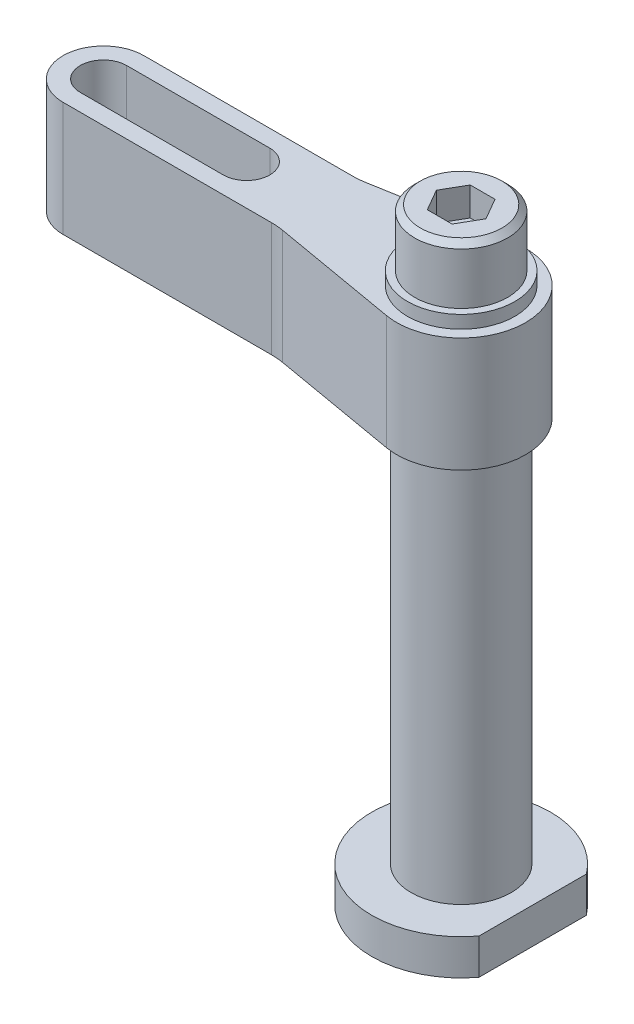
ISO-10303-21;
HEADER;
FILE_DESCRIPTION(('STEP AP214'),'2;1');
FILE_NAME('part.step','',(''),(''),'','','');
FILE_SCHEMA(('AUTOMOTIVE_DESIGN { 1 0 10303 214 1 1 1 1 }'));
ENDSEC;
DATA;
#1=APPLICATION_CONTEXT('core data for automotive mechanical design processes');
#2=APPLICATION_PROTOCOL_DEFINITION('international standard','automotive_design',2000,#1);
#3=PRODUCT_CONTEXT('',#1,'mechanical');
#4=PRODUCT('Part','Part','',(#3));
#5=PRODUCT_RELATED_PRODUCT_CATEGORY('part','',(#4));
#6=PRODUCT_DEFINITION_FORMATION('','',#4);
#7=PRODUCT_DEFINITION_CONTEXT('part definition',#1,'design');
#8=PRODUCT_DEFINITION('design','',#6,#7);
#9=PRODUCT_DEFINITION_SHAPE('','',#8);
#10=(LENGTH_UNIT() NAMED_UNIT(*) SI_UNIT(.MILLI.,.METRE.));
#11=(NAMED_UNIT(*) PLANE_ANGLE_UNIT() SI_UNIT($,.RADIAN.));
#12=(NAMED_UNIT(*) SI_UNIT($,.STERADIAN.) SOLID_ANGLE_UNIT());
#13=UNCERTAINTY_MEASURE_WITH_UNIT(LENGTH_MEASURE(1.E-05),#10,'distance_accuracy_value','');
#14=(GEOMETRIC_REPRESENTATION_CONTEXT(3) GLOBAL_UNCERTAINTY_ASSIGNED_CONTEXT((#13)) GLOBAL_UNIT_ASSIGNED_CONTEXT((#10,
#11,#12)) REPRESENTATION_CONTEXT('',''));
#15=CARTESIAN_POINT('',(0.,0.,0.));
#16=DIRECTION('',(0.,0.,1.));
#17=DIRECTION('',(1.,0.,0.));
#18=AXIS2_PLACEMENT_3D('',#15,#16,#17);
#19=CARTESIAN_POINT('',(0.,80.8,0.));
#20=DIRECTION('',(0.,1.,0.));
#21=DIRECTION('',(0.,0.,1.));
#22=AXIS2_PLACEMENT_3D('',#19,#20,#21);
#23=PLANE('',#22);
#24=DIRECTION('',(-0.5,0.,-0.866025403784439));
#25=VECTOR('',#24,1.);
#26=CARTESIAN_POINT('',(3.46410161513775,80.8,0.));
#27=LINE('',#26,#25);
#28=CARTESIAN_POINT('',(3.46410161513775,80.8,0.));
#29=VERTEX_POINT('',#28);
#30=CARTESIAN_POINT('',(1.73205080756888,80.8,-3.));
#31=VERTEX_POINT('',#30);
#32=EDGE_CURVE('E218',#29,#31,#27,.T.);
#33=ORIENTED_EDGE('',*,*,#32,.T.);
#34=DIRECTION('',(-1.,0.,0.));
#35=VECTOR('',#34,1.);
#36=CARTESIAN_POINT('',(1.73205080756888,80.8,-3.));
#37=LINE('',#36,#35);
#38=CARTESIAN_POINT('',(-1.73205080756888,80.8,-3.));
#39=VERTEX_POINT('',#38);
#40=EDGE_CURVE('E212',#31,#39,#37,.T.);
#41=ORIENTED_EDGE('',*,*,#40,.T.);
#42=DIRECTION('',(-0.5,0.,0.866025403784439));
#43=VECTOR('',#42,1.);
#44=CARTESIAN_POINT('',(-1.73205080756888,80.8,-3.));
#45=LINE('',#44,#43);
#46=CARTESIAN_POINT('',(-3.46410161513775,80.8,0.));
#47=VERTEX_POINT('',#46);
#48=EDGE_CURVE('E206',#39,#47,#45,.T.);
#49=ORIENTED_EDGE('',*,*,#48,.T.);
#50=DIRECTION('',(0.5,0.,0.866025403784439));
#51=VECTOR('',#50,1.);
#52=CARTESIAN_POINT('',(-3.46410161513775,80.8,0.));
#53=LINE('',#52,#51);
#54=CARTESIAN_POINT('',(-1.73205080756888,80.8,3.));
#55=VERTEX_POINT('',#54);
#56=EDGE_CURVE('E200',#47,#55,#53,.T.);
#57=ORIENTED_EDGE('',*,*,#56,.T.);
#58=DIRECTION('',(1.,0.,0.));
#59=VECTOR('',#58,1.);
#60=CARTESIAN_POINT('',(-1.73205080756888,80.8,3.));
#61=LINE('',#60,#59);
#62=CARTESIAN_POINT('',(1.73205080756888,80.8,3.));
#63=VERTEX_POINT('',#62);
#64=EDGE_CURVE('E230',#55,#63,#61,.T.);
#65=ORIENTED_EDGE('',*,*,#64,.T.);
#66=DIRECTION('',(0.5,0.,-0.866025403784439));
#67=VECTOR('',#66,1.);
#68=CARTESIAN_POINT('',(1.73205080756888,80.8,3.));
#69=LINE('',#68,#67);
#70=EDGE_CURVE('E224',#63,#29,#69,.T.);
#71=ORIENTED_EDGE('',*,*,#70,.T.);
#72=EDGE_LOOP('',(#33,#41,#49,#57,#65,#71));
#73=FACE_BOUND('',#72,.T.);
#74=ADVANCED_FACE('F16',(#73),#23,.T.);
#75=CARTESIAN_POINT('',(-1.73205080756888,80.8,3.));
#76=DIRECTION('',(0.,0.,1.));
#77=DIRECTION('',(1.,0.,0.));
#78=AXIS2_PLACEMENT_3D('',#75,#76,#77);
#79=PLANE('',#78);
#80=DIRECTION('',(0.,1.,0.));
#81=VECTOR('',#80,1.);
#82=CARTESIAN_POINT('',(1.73205080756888,80.8,3.));
#83=LINE('',#82,#81);
#84=CARTESIAN_POINT('',(1.73205080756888,84.8,3.));
#85=VERTEX_POINT('',#84);
#86=EDGE_CURVE('E227',#85,#63,#83,.F.);
#87=ORIENTED_EDGE('',*,*,#86,.T.);
#88=ORIENTED_EDGE('',*,*,#64,.F.);
#89=DIRECTION('',(0.,1.,0.));
#90=VECTOR('',#89,1.);
#91=CARTESIAN_POINT('',(-1.73205080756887,80.8,3.));
#92=LINE('',#91,#90);
#93=CARTESIAN_POINT('',(-1.73205080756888,84.8,3.));
#94=VERTEX_POINT('',#93);
#95=EDGE_CURVE('E197',#55,#94,#92,.T.);
#96=ORIENTED_EDGE('',*,*,#95,.T.);
#97=DIRECTION('',(1.,0.,0.));
#98=VECTOR('',#97,1.);
#99=CARTESIAN_POINT('',(0.,84.8,3.));
#100=LINE('',#99,#98);
#101=EDGE_CURVE('E194',#94,#85,#100,.T.);
#102=ORIENTED_EDGE('',*,*,#101,.T.);
#103=EDGE_LOOP('',(#87,#88,#96,#102));
#104=FACE_BOUND('',#103,.T.);
#105=ADVANCED_FACE('F643',(#104),#79,.F.);
#106=CARTESIAN_POINT('',(1.73205080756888,80.8,3.));
#107=DIRECTION('',(0.866025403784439,0.,0.5));
#108=DIRECTION('',(0.5,0.,-0.866025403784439));
#109=AXIS2_PLACEMENT_3D('',#106,#107,#108);
#110=PLANE('',#109);
#111=DIRECTION('',(0.,1.,0.));
#112=VECTOR('',#111,1.);
#113=CARTESIAN_POINT('',(3.46410161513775,80.8,0.));
#114=LINE('',#113,#112);
#115=CARTESIAN_POINT('',(3.46410161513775,84.8,0.));
#116=VERTEX_POINT('',#115);
#117=EDGE_CURVE('E221',#116,#29,#114,.F.);
#118=ORIENTED_EDGE('',*,*,#117,.T.);
#119=ORIENTED_EDGE('',*,*,#70,.F.);
#120=ORIENTED_EDGE('',*,*,#86,.F.);
#121=DIRECTION('',(0.499999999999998,0.,-0.866025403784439));
#122=VECTOR('',#121,1.);
#123=CARTESIAN_POINT('',(1.73205080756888,84.8,3.));
#124=LINE('',#123,#122);
#125=EDGE_CURVE('E191',#85,#116,#124,.T.);
#126=ORIENTED_EDGE('',*,*,#125,.T.);
#127=EDGE_LOOP('',(#118,#119,#120,#126));
#128=FACE_BOUND('',#127,.T.);
#129=ADVANCED_FACE('F634',(#128),#110,.F.);
#130=CARTESIAN_POINT('',(3.46410161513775,80.8,0.));
#131=DIRECTION('',(0.866025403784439,0.,-0.5));
#132=DIRECTION('',(-0.5,0.,-0.866025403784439));
#133=AXIS2_PLACEMENT_3D('',#130,#131,#132);
#134=PLANE('',#133);
#135=DIRECTION('',(0.,1.,0.));
#136=VECTOR('',#135,1.);
#137=CARTESIAN_POINT('',(1.73205080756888,80.8,-3.));
#138=LINE('',#137,#136);
#139=CARTESIAN_POINT('',(1.73205080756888,84.8,-3.));
#140=VERTEX_POINT('',#139);
#141=EDGE_CURVE('E215',#140,#31,#138,.F.);
#142=ORIENTED_EDGE('',*,*,#141,.T.);
#143=ORIENTED_EDGE('',*,*,#32,.F.);
#144=ORIENTED_EDGE('',*,*,#117,.F.);
#145=DIRECTION('',(-0.499999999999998,0.,-0.866025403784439));
#146=VECTOR('',#145,1.);
#147=CARTESIAN_POINT('',(3.46410161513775,84.8,0.));
#148=LINE('',#147,#146);
#149=EDGE_CURVE('E188',#116,#140,#148,.T.);
#150=ORIENTED_EDGE('',*,*,#149,.T.);
#151=EDGE_LOOP('',(#142,#143,#144,#150));
#152=FACE_BOUND('',#151,.T.);
#153=ADVANCED_FACE('F625',(#152),#134,.F.);
#154=CARTESIAN_POINT('',(1.73205080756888,80.8,-3.));
#155=DIRECTION('',(0.,0.,-1.));
#156=DIRECTION('',(-1.,0.,0.));
#157=AXIS2_PLACEMENT_3D('',#154,#155,#156);
#158=PLANE('',#157);
#159=DIRECTION('',(0.,1.,0.));
#160=VECTOR('',#159,1.);
#161=CARTESIAN_POINT('',(-1.73205080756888,80.8,-3.));
#162=LINE('',#161,#160);
#163=CARTESIAN_POINT('',(-1.73205080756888,84.8,-3.));
#164=VERTEX_POINT('',#163);
#165=EDGE_CURVE('E209',#164,#39,#162,.F.);
#166=ORIENTED_EDGE('',*,*,#165,.T.);
#167=ORIENTED_EDGE('',*,*,#40,.F.);
#168=ORIENTED_EDGE('',*,*,#141,.F.);
#169=DIRECTION('',(1.,0.,0.));
#170=VECTOR('',#169,1.);
#171=CARTESIAN_POINT('',(0.,84.8,-3.));
#172=LINE('',#171,#170);
#173=EDGE_CURVE('E185',#140,#164,#172,.F.);
#174=ORIENTED_EDGE('',*,*,#173,.T.);
#175=EDGE_LOOP('',(#166,#167,#168,#174));
#176=FACE_BOUND('',#175,.T.);
#177=ADVANCED_FACE('F616',(#176),#158,.F.);
#178=CARTESIAN_POINT('',(-1.73205080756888,80.8,-3.));
#179=DIRECTION('',(-0.866025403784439,0.,-0.5));
#180=DIRECTION('',(-0.5,0.,0.866025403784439));
#181=AXIS2_PLACEMENT_3D('',#178,#179,#180);
#182=PLANE('',#181);
#183=DIRECTION('',(0.,1.,0.));
#184=VECTOR('',#183,1.);
#185=CARTESIAN_POINT('',(-3.46410161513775,80.8,0.));
#186=LINE('',#185,#184);
#187=CARTESIAN_POINT('',(-3.46410161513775,84.8,0.));
#188=VERTEX_POINT('',#187);
#189=EDGE_CURVE('E203',#188,#47,#186,.F.);
#190=ORIENTED_EDGE('',*,*,#189,.T.);
#191=ORIENTED_EDGE('',*,*,#48,.F.);
#192=ORIENTED_EDGE('',*,*,#165,.F.);
#193=DIRECTION('',(-0.499999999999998,0.,0.866025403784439));
#194=VECTOR('',#193,1.);
#195=CARTESIAN_POINT('',(-1.73205080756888,84.8,-3.));
#196=LINE('',#195,#194);
#197=EDGE_CURVE('E182',#164,#188,#196,.T.);
#198=ORIENTED_EDGE('',*,*,#197,.T.);
#199=EDGE_LOOP('',(#190,#191,#192,#198));
#200=FACE_BOUND('',#199,.T.);
#201=ADVANCED_FACE('F300',(#200),#182,.F.);
#202=CARTESIAN_POINT('',(-3.46410161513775,80.8,0.));
#203=DIRECTION('',(-0.866025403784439,0.,0.5));
#204=DIRECTION('',(0.5,0.,0.866025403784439));
#205=AXIS2_PLACEMENT_3D('',#202,#203,#204);
#206=PLANE('',#205);
#207=ORIENTED_EDGE('',*,*,#95,.F.);
#208=ORIENTED_EDGE('',*,*,#56,.F.);
#209=ORIENTED_EDGE('',*,*,#189,.F.);
#210=DIRECTION('',(0.499999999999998,0.,0.866025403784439));
#211=VECTOR('',#210,1.);
#212=CARTESIAN_POINT('',(-3.46410161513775,84.8,0.));
#213=LINE('',#212,#211);
#214=EDGE_CURVE('E179',#188,#94,#213,.T.);
#215=ORIENTED_EDGE('',*,*,#214,.T.);
#216=EDGE_LOOP('',(#207,#208,#209,#215));
#217=FACE_BOUND('',#216,.T.);
#218=ADVANCED_FACE('F290',(#217),#206,.F.);
#219=CARTESIAN_POINT('',(0.,84.8,0.));
#220=DIRECTION('',(0.,-1.,0.));
#221=DIRECTION('',(0.,0.,-1.));
#222=AXIS2_PLACEMENT_3D('',#219,#220,#221);
#223=PLANE('',#222);
#224=ORIENTED_EDGE('',*,*,#197,.F.);
#225=ORIENTED_EDGE('',*,*,#173,.F.);
#226=ORIENTED_EDGE('',*,*,#149,.F.);
#227=ORIENTED_EDGE('',*,*,#125,.F.);
#228=ORIENTED_EDGE('',*,*,#101,.F.);
#229=ORIENTED_EDGE('',*,*,#214,.F.);
#230=EDGE_LOOP('',(#224,#225,#226,#227,#228,#229));
#231=FACE_BOUND('',#230,.T.);
#232=CARTESIAN_POINT('',(0.,84.7999999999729,0.));
#233=DIRECTION('',(0.,-1.,0.));
#234=DIRECTION('',(0.,0.,-1.));
#235=AXIS2_PLACEMENT_3D('',#232,#233,#234);
#236=CIRCLE('',#235,5.69999999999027);
#237=CARTESIAN_POINT('',(0.,84.7999999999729,-5.69999999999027));
#238=VERTEX_POINT('',#237);
#239=EDGE_CURVE('E176',#238,#238,#236,.T.);
#240=ORIENTED_EDGE('',*,*,#239,.F.);
#241=EDGE_LOOP('',(#240));
#242=FACE_BOUND('',#241,.T.);
#243=ADVANCED_FACE('F288',(#231,#242),#223,.F.);
#244=CARTESIAN_POINT('',(0.,84.0000000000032,0.));
#245=DIRECTION('',(0.,-1.,0.));
#246=DIRECTION('',(0.,0.,-1.));
#247=AXIS2_PLACEMENT_3D('',#244,#245,#246);
#248=CONICAL_SURFACE('',#247,6.49999999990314,0.785398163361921);
#249=ORIENTED_EDGE('',*,*,#239,.T.);
#250=EDGE_LOOP('',(#249));
#251=FACE_BOUND('',#250,.T.);
#252=CARTESIAN_POINT('',(0.,84.,0.));
#253=DIRECTION('',(0.,1.,0.));
#254=DIRECTION('',(0.,0.,1.));
#255=AXIS2_PLACEMENT_3D('',#252,#253,#254);
#256=CIRCLE('',#255,6.5);
#257=CARTESIAN_POINT('',(0.,84.,6.5));
#258=VERTEX_POINT('',#257);
#259=EDGE_CURVE('E172',#258,#258,#256,.F.);
#260=ORIENTED_EDGE('',*,*,#259,.F.);
#261=EDGE_LOOP('',(#260));
#262=FACE_BOUND('',#261,.T.);
#263=ADVANCED_FACE('F285',(#251,#262),#248,.T.);
#264=CARTESIAN_POINT('',(0.,0.,0.));
#265=DIRECTION('',(0.,1.,0.));
#266=DIRECTION('',(0.,0.,1.));
#267=AXIS2_PLACEMENT_3D('',#264,#265,#266);
#268=CYLINDRICAL_SURFACE('',#267,6.5);
#269=ORIENTED_EDGE('',*,*,#259,.T.);
#270=EDGE_LOOP('',(#269));
#271=FACE_BOUND('',#270,.T.);
#272=CARTESIAN_POINT('',(0.,76.8,0.));
#273=DIRECTION('',(0.,1.,0.));
#274=DIRECTION('',(0.,0.,1.));
#275=AXIS2_PLACEMENT_3D('',#272,#273,#274);
#276=CIRCLE('',#275,6.5);
#277=CARTESIAN_POINT('',(0.,76.8,6.5));
#278=VERTEX_POINT('',#277);
#279=EDGE_CURVE('E175',#278,#278,#276,.T.);
#280=ORIENTED_EDGE('',*,*,#279,.T.);
#281=EDGE_LOOP('',(#280));
#282=FACE_BOUND('',#281,.T.);
#283=ADVANCED_FACE('F298',(#271,#282),#268,.T.);
#284=CARTESIAN_POINT('',(6.5,76.8,0.));
#285=DIRECTION('',(0.,-1.,0.));
#286=DIRECTION('',(0.,0.,-1.));
#287=AXIS2_PLACEMENT_3D('',#284,#285,#286);
#288=PLANE('',#287);
#289=ORIENTED_EDGE('',*,*,#279,.F.);
#290=EDGE_LOOP('',(#289));
#291=FACE_BOUND('',#290,.T.);
#292=CARTESIAN_POINT('',(0.,76.8,0.));
#293=DIRECTION('',(0.,1.,0.));
#294=DIRECTION('',(0.,0.,1.));
#295=AXIS2_PLACEMENT_3D('',#292,#293,#294);
#296=CIRCLE('',#295,7.5);
#297=CARTESIAN_POINT('',(0.,76.8,7.5));
#298=VERTEX_POINT('',#297);
#299=EDGE_CURVE('E274',#298,#298,#296,.F.);
#300=ORIENTED_EDGE('',*,*,#299,.F.);
#301=EDGE_LOOP('',(#300));
#302=FACE_BOUND('',#301,.T.);
#303=ADVANCED_FACE('F378',(#291,#302),#288,.F.);
#304=CARTESIAN_POINT('',(0.,0.,0.));
#305=DIRECTION('',(0.,1.,0.));
#306=DIRECTION('',(0.,0.,1.));
#307=AXIS2_PLACEMENT_3D('',#304,#305,#306);
#308=CYLINDRICAL_SURFACE('',#307,7.5);
#309=ORIENTED_EDGE('',*,*,#299,.T.);
#310=EDGE_LOOP('',(#309));
#311=FACE_BOUND('',#310,.T.);
#312=CARTESIAN_POINT('',(0.,75.,0.));
#313=DIRECTION('',(0.,1.,0.));
#314=DIRECTION('',(0.,0.,1.));
#315=AXIS2_PLACEMENT_3D('',#312,#313,#314);
#316=CIRCLE('',#315,7.5);
#317=CARTESIAN_POINT('',(0.,75.,7.5));
#318=VERTEX_POINT('',#317);
#319=EDGE_CURVE('E142',#318,#318,#316,.F.);
#320=ORIENTED_EDGE('',*,*,#319,.F.);
#321=EDGE_LOOP('',(#320));
#322=FACE_BOUND('',#321,.T.);
#323=ADVANCED_FACE('F374',(#311,#322),#308,.T.);
#324=CARTESIAN_POINT('',(12.5,0.,0.));
#325=DIRECTION('',(0.,1.,0.));
#326=DIRECTION('',(0.,0.,1.));
#327=AXIS2_PLACEMENT_3D('',#324,#325,#326);
#328=PLANE('',#327);
#329=CARTESIAN_POINT('',(0.,0.,0.));
#330=DIRECTION('',(0.,1.,0.));
#331=DIRECTION('',(0.,0.,1.));
#332=AXIS2_PLACEMENT_3D('',#329,#330,#331);
#333=CIRCLE('',#332,12.5);
#334=CARTESIAN_POINT('',(10.,0.,-7.5));
#335=VERTEX_POINT('',#334);
#336=CARTESIAN_POINT('',(10.,0.,7.5));
#337=VERTEX_POINT('',#336);
#338=EDGE_CURVE('E264',#335,#337,#333,.T.);
#339=ORIENTED_EDGE('',*,*,#338,.F.);
#340=DIRECTION('',(0.,0.,-1.));
#341=VECTOR('',#340,1.);
#342=CARTESIAN_POINT('',(10.,0.,-10.));
#343=LINE('',#342,#341);
#344=EDGE_CURVE('E167',#337,#335,#343,.T.);
#345=ORIENTED_EDGE('',*,*,#344,.F.);
#346=EDGE_LOOP('',(#339,#345));
#347=FACE_BOUND('',#346,.T.);
#348=ADVANCED_FACE('F371',(#347),#328,.F.);
#349=CARTESIAN_POINT('',(-20.864897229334,75.,15.6500000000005));
#350=DIRECTION('',(0.,1.,0.));
#351=DIRECTION('',(0.,0.,1.));
#352=AXIS2_PLACEMENT_3D('',#349,#350,#351);
#353=CYLINDRICAL_SURFACE('',#352,10.);
#354=DIRECTION('',(0.,1.,0.));
#355=VECTOR('',#354,1.);
#356=CARTESIAN_POINT('',(-19.1479463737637,75.,5.79849860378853));
#357=LINE('',#356,#355);
#358=CARTESIAN_POINT('',(-19.1479463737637,59.,5.79849860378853));
#359=VERTEX_POINT('',#358);
#360=CARTESIAN_POINT('',(-19.1479463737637,75.,5.79849860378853));
#361=VERTEX_POINT('',#360);
#362=EDGE_CURVE('E126',#359,#361,#357,.T.);
#363=ORIENTED_EDGE('',*,*,#362,.T.);
#364=CARTESIAN_POINT('',(-20.864897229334,75.,15.6500000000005));
#365=DIRECTION('',(0.,1.,0.));
#366=DIRECTION('',(0.,0.,1.));
#367=AXIS2_PLACEMENT_3D('',#364,#365,#366);
#368=CIRCLE('',#367,10.);
#369=CARTESIAN_POINT('',(-20.864897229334,75.,5.65));
#370=VERTEX_POINT('',#369);
#371=EDGE_CURVE('E124',#370,#361,#368,.F.);
#372=ORIENTED_EDGE('',*,*,#371,.F.);
#373=DIRECTION('',(0.,1.,0.));
#374=VECTOR('',#373,1.);
#375=CARTESIAN_POINT('',(-20.864897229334,75.,5.65));
#376=LINE('',#375,#374);
#377=CARTESIAN_POINT('',(-20.864897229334,59.,5.65));
#378=VERTEX_POINT('',#377);
#379=EDGE_CURVE('E131',#370,#378,#376,.F.);
#380=ORIENTED_EDGE('',*,*,#379,.T.);
#381=CARTESIAN_POINT('',(-20.864897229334,59.,15.6500000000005));
#382=DIRECTION('',(0.,1.,0.));
#383=DIRECTION('',(0.,0.,1.));
#384=AXIS2_PLACEMENT_3D('',#381,#382,#383);
#385=CIRCLE('',#384,10.);
#386=EDGE_CURVE('E48',#359,#378,#385,.T.);
#387=ORIENTED_EDGE('',*,*,#386,.F.);
#388=EDGE_LOOP('',(#363,#372,#380,#387));
#389=FACE_BOUND('',#388,.T.);
#390=ADVANCED_FACE('F127',(#389),#353,.F.);
#391=CARTESIAN_POINT('',(-20.864897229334,75.,-15.6500000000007));
#392=DIRECTION('',(0.,1.,0.));
#393=DIRECTION('',(0.,0.,1.));
#394=AXIS2_PLACEMENT_3D('',#391,#392,#393);
#395=CYLINDRICAL_SURFACE('',#394,10.);
#396=DIRECTION('',(0.,1.,0.));
#397=VECTOR('',#396,1.);
#398=CARTESIAN_POINT('',(-20.864897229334,75.,-5.65));
#399=LINE('',#398,#397);
#400=CARTESIAN_POINT('',(-20.864897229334,59.,-5.65));
#401=VERTEX_POINT('',#400);
#402=CARTESIAN_POINT('',(-20.864897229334,75.,-5.65));
#403=VERTEX_POINT('',#402);
#404=EDGE_CURVE('E718',#401,#403,#399,.T.);
#405=ORIENTED_EDGE('',*,*,#404,.T.);
#406=CARTESIAN_POINT('',(-20.864897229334,75.,-15.6500000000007));
#407=DIRECTION('',(0.,1.,0.));
#408=DIRECTION('',(0.,0.,1.));
#409=AXIS2_PLACEMENT_3D('',#406,#407,#408);
#410=CIRCLE('',#409,10.);
#411=CARTESIAN_POINT('',(-19.1479463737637,75.,-5.79849860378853));
#412=VERTEX_POINT('',#411);
#413=EDGE_CURVE('E141',#412,#403,#410,.F.);
#414=ORIENTED_EDGE('',*,*,#413,.F.);
#415=DIRECTION('',(0.,1.,0.));
#416=VECTOR('',#415,1.);
#417=CARTESIAN_POINT('',(-19.1479463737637,75.,-5.79849860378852));
#418=LINE('',#417,#416);
#419=CARTESIAN_POINT('',(-19.1479463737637,59.,-5.79849860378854));
#420=VERTEX_POINT('',#419);
#421=EDGE_CURVE('E721',#412,#420,#418,.F.);
#422=ORIENTED_EDGE('',*,*,#421,.T.);
#423=CARTESIAN_POINT('',(-20.864897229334,59.,-15.6500000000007));
#424=DIRECTION('',(0.,1.,0.));
#425=DIRECTION('',(0.,0.,1.));
#426=AXIS2_PLACEMENT_3D('',#423,#424,#425);
#427=CIRCLE('',#426,10.);
#428=EDGE_CURVE('E34',#401,#420,#427,.T.);
#429=ORIENTED_EDGE('',*,*,#428,.F.);
#430=EDGE_LOOP('',(#405,#414,#422,#429));
#431=FACE_BOUND('',#430,.T.);
#432=ADVANCED_FACE('F366',(#431),#395,.F.);
#433=CARTESIAN_POINT('',(-50.,75.,0.));
#434=DIRECTION('',(0.,1.,0.));
#435=DIRECTION('',(0.,0.,1.));
#436=AXIS2_PLACEMENT_3D('',#433,#434,#435);
#437=PLANE('',#436);
#438=DIRECTION('',(0.985150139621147,0.,-0.171695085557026));
#439=VECTOR('',#438,1.);
#440=CARTESIAN_POINT('',(-1.54525577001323,75.,-8.86635125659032));
#441=LINE('',#440,#439);
#442=CARTESIAN_POINT('',(-1.54525577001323,75.,-8.86635125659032));
#443=VERTEX_POINT('',#442);
#444=EDGE_CURVE('E153',#443,#412,#441,.F.);
#445=ORIENTED_EDGE('',*,*,#444,.T.);
#446=ORIENTED_EDGE('',*,*,#413,.T.);
#447=DIRECTION('',(1.,0.,0.));
#448=VECTOR('',#447,1.);
#449=CARTESIAN_POINT('',(-20.864897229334,75.,-5.65));
#450=LINE('',#449,#448);
#451=CARTESIAN_POINT('',(-50.,75.,-5.65));
#452=VERTEX_POINT('',#451);
#453=EDGE_CURVE('E720',#403,#452,#450,.F.);
#454=ORIENTED_EDGE('',*,*,#453,.T.);
#455=CARTESIAN_POINT('',(-50.,75.,0.));
#456=DIRECTION('',(0.,1.,0.));
#457=DIRECTION('',(0.,0.,1.));
#458=AXIS2_PLACEMENT_3D('',#455,#456,#457);
#459=CIRCLE('',#458,5.65);
#460=CARTESIAN_POINT('',(-50.,75.,5.65));
#461=VERTEX_POINT('',#460);
#462=EDGE_CURVE('E257',#461,#452,#459,.F.);
#463=ORIENTED_EDGE('',*,*,#462,.F.);
#464=DIRECTION('',(-1.,0.,0.));
#465=VECTOR('',#464,1.);
#466=CARTESIAN_POINT('',(-50.,75.,5.65));
#467=LINE('',#466,#465);
#468=EDGE_CURVE('E139',#461,#370,#467,.F.);
#469=ORIENTED_EDGE('',*,*,#468,.T.);
#470=ORIENTED_EDGE('',*,*,#371,.T.);
#471=DIRECTION('',(-0.985150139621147,0.,-0.171695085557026));
#472=VECTOR('',#471,1.);
#473=CARTESIAN_POINT('',(-19.1479463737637,75.,5.79849860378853));
#474=LINE('',#473,#472);
#475=CARTESIAN_POINT('',(-1.54525577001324,75.,8.86635125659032));
#476=VERTEX_POINT('',#475);
#477=EDGE_CURVE('E130',#361,#476,#474,.F.);
#478=ORIENTED_EDGE('',*,*,#477,.T.);
#479=CARTESIAN_POINT('',(0.,75.,0.));
#480=DIRECTION('',(0.,1.,0.));
#481=DIRECTION('',(0.,0.,1.));
#482=AXIS2_PLACEMENT_3D('',#479,#480,#481);
#483=CIRCLE('',#482,9.);
#484=EDGE_CURVE('E148',#443,#476,#483,.F.);
#485=ORIENTED_EDGE('',*,*,#484,.F.);
#486=EDGE_LOOP('',(#445,#446,#454,#463,#469,#470,#478,#485));
#487=FACE_BOUND('',#486,.T.);
#488=DIRECTION('',(-1.,0.,0.));
#489=VECTOR('',#488,1.);
#490=CARTESIAN_POINT('',(-50.,75.,3.25));
#491=LINE('',#490,#489);
#492=CARTESIAN_POINT('',(-50.,75.,3.25));
#493=VERTEX_POINT('',#492);
#494=CARTESIAN_POINT('',(-30.,75.,3.25));
#495=VERTEX_POINT('',#494);
#496=EDGE_CURVE('E162',#493,#495,#491,.F.);
#497=ORIENTED_EDGE('',*,*,#496,.F.);
#498=CARTESIAN_POINT('',(-50.,75.,0.));
#499=DIRECTION('',(0.,1.,0.));
#500=DIRECTION('',(0.,0.,1.));
#501=AXIS2_PLACEMENT_3D('',#498,#499,#500);
#502=CIRCLE('',#501,3.25);
#503=CARTESIAN_POINT('',(-50.,75.,-3.25));
#504=VERTEX_POINT('',#503);
#505=EDGE_CURVE('E260',#493,#504,#502,.F.);
#506=ORIENTED_EDGE('',*,*,#505,.T.);
#507=DIRECTION('',(1.,0.,0.));
#508=VECTOR('',#507,1.);
#509=CARTESIAN_POINT('',(-30.,75.,-3.25));
#510=LINE('',#509,#508);
#511=CARTESIAN_POINT('',(-30.,75.,-3.25));
#512=VERTEX_POINT('',#511);
#513=EDGE_CURVE('E157',#512,#504,#510,.F.);
#514=ORIENTED_EDGE('',*,*,#513,.F.);
#515=CARTESIAN_POINT('',(-30.,75.,0.));
#516=DIRECTION('',(0.,1.,0.));
#517=DIRECTION('',(0.,0.,1.));
#518=AXIS2_PLACEMENT_3D('',#515,#516,#517);
#519=CIRCLE('',#518,3.25);
#520=EDGE_CURVE('E166',#512,#495,#519,.F.);
#521=ORIENTED_EDGE('',*,*,#520,.T.);
#522=EDGE_LOOP('',(#497,#506,#514,#521));
#523=FACE_BOUND('',#522,.T.);
#524=ORIENTED_EDGE('',*,*,#319,.T.);
#525=EDGE_LOOP('',(#524));
#526=FACE_BOUND('',#525,.T.);
#527=ADVANCED_FACE('F135',(#487,#523,#526),#437,.T.);
#528=CARTESIAN_POINT('',(0.,0.,0.));
#529=DIRECTION('',(0.,1.,0.));
#530=DIRECTION('',(0.,0.,1.));
#531=AXIS2_PLACEMENT_3D('',#528,#529,#530);
#532=CYLINDRICAL_SURFACE('',#531,12.5);
#533=DIRECTION('',(0.,1.,0.));
#534=VECTOR('',#533,1.);
#535=CARTESIAN_POINT('',(10.,5.,-7.5));
#536=LINE('',#535,#534);
#537=CARTESIAN_POINT('',(10.,5.,-7.5));
#538=VERTEX_POINT('',#537);
#539=EDGE_CURVE('E170',#335,#538,#536,.T.);
#540=ORIENTED_EDGE('',*,*,#539,.F.);
#541=ORIENTED_EDGE('',*,*,#338,.T.);
#542=DIRECTION('',(0.,1.,0.));
#543=VECTOR('',#542,1.);
#544=CARTESIAN_POINT('',(10.,5.,7.5));
#545=LINE('',#544,#543);
#546=CARTESIAN_POINT('',(10.,5.,7.5));
#547=VERTEX_POINT('',#546);
#548=EDGE_CURVE('E171',#547,#337,#545,.F.);
#549=ORIENTED_EDGE('',*,*,#548,.F.);
#550=CARTESIAN_POINT('',(0.,5.,0.));
#551=DIRECTION('',(0.,1.,0.));
#552=DIRECTION('',(0.,0.,1.));
#553=AXIS2_PLACEMENT_3D('',#550,#551,#552);
#554=CIRCLE('',#553,12.5);
#555=EDGE_CURVE('E254',#547,#538,#554,.F.);
#556=ORIENTED_EDGE('',*,*,#555,.T.);
#557=EDGE_LOOP('',(#540,#541,#549,#556));
#558=FACE_BOUND('',#557,.T.);
#559=ADVANCED_FACE('F359',(#558),#532,.T.);
#560=CARTESIAN_POINT('',(10.,5.,-10.));
#561=DIRECTION('',(1.,0.,0.));
#562=DIRECTION('',(0.,0.,-1.));
#563=AXIS2_PLACEMENT_3D('',#560,#561,#562);
#564=PLANE('',#563);
#565=ORIENTED_EDGE('',*,*,#539,.T.);
#566=DIRECTION('',(0.,0.,-1.));
#567=VECTOR('',#566,1.);
#568=CARTESIAN_POINT('',(10.,5.,0.));
#569=LINE('',#568,#567);
#570=EDGE_CURVE('E253',#538,#547,#569,.F.);
#571=ORIENTED_EDGE('',*,*,#570,.T.);
#572=ORIENTED_EDGE('',*,*,#548,.T.);
#573=ORIENTED_EDGE('',*,*,#344,.T.);
#574=EDGE_LOOP('',(#565,#571,#572,#573));
#575=FACE_BOUND('',#574,.T.);
#576=ADVANCED_FACE('F355',(#575),#564,.T.);
#577=CARTESIAN_POINT('',(-30.,75.,0.));
#578=DIRECTION('',(0.,1.,0.));
#579=DIRECTION('',(0.,0.,1.));
#580=AXIS2_PLACEMENT_3D('',#577,#578,#579);
#581=CYLINDRICAL_SURFACE('',#580,3.25);
#582=DIRECTION('',(0.,1.,0.));
#583=VECTOR('',#582,1.);
#584=CARTESIAN_POINT('',(-30.,75.,3.25));
#585=LINE('',#584,#583);
#586=CARTESIAN_POINT('',(-30.,59.,3.25));
#587=VERTEX_POINT('',#586);
#588=EDGE_CURVE('E165',#495,#587,#585,.F.);
#589=ORIENTED_EDGE('',*,*,#588,.F.);
#590=ORIENTED_EDGE('',*,*,#520,.F.);
#591=DIRECTION('',(0.,1.,0.));
#592=VECTOR('',#591,1.);
#593=CARTESIAN_POINT('',(-30.,75.,-3.25));
#594=LINE('',#593,#592);
#595=CARTESIAN_POINT('',(-30.,59.,-3.25));
#596=VERTEX_POINT('',#595);
#597=EDGE_CURVE('E161',#596,#512,#594,.T.);
#598=ORIENTED_EDGE('',*,*,#597,.F.);
#599=CARTESIAN_POINT('',(-30.,59.,0.));
#600=DIRECTION('',(0.,1.,0.));
#601=DIRECTION('',(0.,0.,1.));
#602=AXIS2_PLACEMENT_3D('',#599,#600,#601);
#603=CIRCLE('',#602,3.25);
#604=EDGE_CURVE('E251',#596,#587,#603,.F.);
#605=ORIENTED_EDGE('',*,*,#604,.T.);
#606=EDGE_LOOP('',(#589,#590,#598,#605));
#607=FACE_BOUND('',#606,.T.);
#608=ADVANCED_FACE('F351',(#607),#581,.F.);
#609=CARTESIAN_POINT('',(-50.,75.,3.25));
#610=DIRECTION('',(0.,0.,-1.));
#611=DIRECTION('',(-1.,0.,0.));
#612=AXIS2_PLACEMENT_3D('',#609,#610,#611);
#613=PLANE('',#612);
#614=ORIENTED_EDGE('',*,*,#496,.T.);
#615=ORIENTED_EDGE('',*,*,#588,.T.);
#616=DIRECTION('',(1.,0.,0.));
#617=VECTOR('',#616,1.);
#618=CARTESIAN_POINT('',(-50.,59.,3.25));
#619=LINE('',#618,#617);
#620=CARTESIAN_POINT('',(-50.,59.,3.25));
#621=VERTEX_POINT('',#620);
#622=EDGE_CURVE('E250',#587,#621,#619,.F.);
#623=ORIENTED_EDGE('',*,*,#622,.T.);
#624=DIRECTION('',(0.,1.,0.));
#625=VECTOR('',#624,1.);
#626=CARTESIAN_POINT('',(-50.,75.,3.25));
#627=LINE('',#626,#625);
#628=EDGE_CURVE('E262',#621,#493,#627,.T.);
#629=ORIENTED_EDGE('',*,*,#628,.T.);
#630=EDGE_LOOP('',(#614,#615,#623,#629));
#631=FACE_BOUND('',#630,.T.);
#632=ADVANCED_FACE('F347',(#631),#613,.T.);
#633=CARTESIAN_POINT('',(-50.,75.,0.));
#634=DIRECTION('',(0.,1.,0.));
#635=DIRECTION('',(0.,0.,1.));
#636=AXIS2_PLACEMENT_3D('',#633,#634,#635);
#637=CYLINDRICAL_SURFACE('',#636,3.25);
#638=DIRECTION('',(0.,1.,0.));
#639=VECTOR('',#638,1.);
#640=CARTESIAN_POINT('',(-50.,75.,-3.25));
#641=LINE('',#640,#639);
#642=CARTESIAN_POINT('',(-50.,59.,-3.25));
#643=VERTEX_POINT('',#642);
#644=EDGE_CURVE('E160',#504,#643,#641,.F.);
#645=ORIENTED_EDGE('',*,*,#644,.F.);
#646=ORIENTED_EDGE('',*,*,#505,.F.);
#647=ORIENTED_EDGE('',*,*,#628,.F.);
#648=CARTESIAN_POINT('',(-50.,59.,0.));
#649=DIRECTION('',(0.,1.,0.));
#650=DIRECTION('',(0.,0.,1.));
#651=AXIS2_PLACEMENT_3D('',#648,#649,#650);
#652=CIRCLE('',#651,3.25);
#653=EDGE_CURVE('E248',#621,#643,#652,.F.);
#654=ORIENTED_EDGE('',*,*,#653,.T.);
#655=EDGE_LOOP('',(#645,#646,#647,#654));
#656=FACE_BOUND('',#655,.T.);
#657=ADVANCED_FACE('F343',(#656),#637,.F.);
#658=CARTESIAN_POINT('',(-30.,75.,-3.25));
#659=DIRECTION('',(0.,0.,1.));
#660=DIRECTION('',(1.,0.,0.));
#661=AXIS2_PLACEMENT_3D('',#658,#659,#660);
#662=PLANE('',#661);
#663=ORIENTED_EDGE('',*,*,#513,.T.);
#664=ORIENTED_EDGE('',*,*,#644,.T.);
#665=DIRECTION('',(1.,0.,0.));
#666=VECTOR('',#665,1.);
#667=CARTESIAN_POINT('',(-50.,59.,-3.25));
#668=LINE('',#667,#666);
#669=EDGE_CURVE('E247',#643,#596,#668,.T.);
#670=ORIENTED_EDGE('',*,*,#669,.T.);
#671=ORIENTED_EDGE('',*,*,#597,.T.);
#672=EDGE_LOOP('',(#663,#664,#670,#671));
#673=FACE_BOUND('',#672,.T.);
#674=ADVANCED_FACE('F340',(#673),#662,.T.);
#675=CARTESIAN_POINT('',(-50.,75.,0.));
#676=DIRECTION('',(0.,1.,0.));
#677=DIRECTION('',(0.,0.,1.));
#678=AXIS2_PLACEMENT_3D('',#675,#676,#677);
#679=CYLINDRICAL_SURFACE('',#678,5.65);
#680=ORIENTED_EDGE('',*,*,#462,.T.);
#681=DIRECTION('',(0.,1.,0.));
#682=VECTOR('',#681,1.);
#683=CARTESIAN_POINT('',(-50.,75.,-5.65));
#684=LINE('',#683,#682);
#685=CARTESIAN_POINT('',(-50.,59.,-5.65));
#686=VERTEX_POINT('',#685);
#687=EDGE_CURVE('E255',#452,#686,#684,.F.);
#688=ORIENTED_EDGE('',*,*,#687,.T.);
#689=CARTESIAN_POINT('',(-50.,59.,0.));
#690=DIRECTION('',(0.,1.,0.));
#691=DIRECTION('',(0.,0.,1.));
#692=AXIS2_PLACEMENT_3D('',#689,#690,#691);
#693=CIRCLE('',#692,5.65);
#694=CARTESIAN_POINT('',(-50.,59.,5.65));
#695=VERTEX_POINT('',#694);
#696=EDGE_CURVE('E63',#686,#695,#693,.T.);
#697=ORIENTED_EDGE('',*,*,#696,.T.);
#698=DIRECTION('',(0.,1.,0.));
#699=VECTOR('',#698,1.);
#700=CARTESIAN_POINT('',(-50.,75.,5.65));
#701=LINE('',#700,#699);
#702=EDGE_CURVE('E156',#695,#461,#701,.T.);
#703=ORIENTED_EDGE('',*,*,#702,.T.);
#704=EDGE_LOOP('',(#680,#688,#697,#703));
#705=FACE_BOUND('',#704,.T.);
#706=ADVANCED_FACE('F336',(#705),#679,.T.);
#707=CARTESIAN_POINT('',(-50.,75.,5.65));
#708=DIRECTION('',(0.,0.,-1.));
#709=DIRECTION('',(-1.,0.,0.));
#710=AXIS2_PLACEMENT_3D('',#707,#708,#709);
#711=PLANE('',#710);
#712=ORIENTED_EDGE('',*,*,#379,.F.);
#713=ORIENTED_EDGE('',*,*,#468,.F.);
#714=ORIENTED_EDGE('',*,*,#702,.F.);
#715=DIRECTION('',(1.,0.,0.));
#716=VECTOR('',#715,1.);
#717=CARTESIAN_POINT('',(-50.,59.,5.65));
#718=LINE('',#717,#716);
#719=EDGE_CURVE('E246',#695,#378,#718,.T.);
#720=ORIENTED_EDGE('',*,*,#719,.T.);
#721=EDGE_LOOP('',(#712,#713,#714,#720));
#722=FACE_BOUND('',#721,.T.);
#723=ADVANCED_FACE('F333',(#722),#711,.F.);
#724=CARTESIAN_POINT('',(-19.1479463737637,75.,5.79849860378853));
#725=DIRECTION('',(0.171695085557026,0.,-0.985150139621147));
#726=DIRECTION('',(-0.985150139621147,0.,-0.171695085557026));
#727=AXIS2_PLACEMENT_3D('',#724,#725,#726);
#728=PLANE('',#727);
#729=DIRECTION('',(0.,1.,0.));
#730=VECTOR('',#729,1.);
#731=CARTESIAN_POINT('',(-1.54525577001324,75.,8.86635125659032));
#732=LINE('',#731,#730);
#733=CARTESIAN_POINT('',(-1.54525577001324,59.,8.86635125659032));
#734=VERTEX_POINT('',#733);
#735=EDGE_CURVE('E146',#476,#734,#732,.F.);
#736=ORIENTED_EDGE('',*,*,#735,.F.);
#737=ORIENTED_EDGE('',*,*,#477,.F.);
#738=ORIENTED_EDGE('',*,*,#362,.F.);
#739=DIRECTION('',(0.985150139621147,0.,0.171695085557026));
#740=VECTOR('',#739,1.);
#741=CARTESIAN_POINT('',(-19.1479463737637,59.,5.79849860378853));
#742=LINE('',#741,#740);
#743=EDGE_CURVE('E244',#359,#734,#742,.T.);
#744=ORIENTED_EDGE('',*,*,#743,.T.);
#745=EDGE_LOOP('',(#736,#737,#738,#744));
#746=FACE_BOUND('',#745,.T.);
#747=ADVANCED_FACE('F144',(#746),#728,.F.);
#748=CARTESIAN_POINT('',(0.,75.,0.));
#749=DIRECTION('',(0.,1.,0.));
#750=DIRECTION('',(0.,0.,1.));
#751=AXIS2_PLACEMENT_3D('',#748,#749,#750);
#752=CYLINDRICAL_SURFACE('',#751,9.);
#753=ORIENTED_EDGE('',*,*,#484,.T.);
#754=ORIENTED_EDGE('',*,*,#735,.T.);
#755=CARTESIAN_POINT('',(0.,59.,0.));
#756=DIRECTION('',(0.,1.,0.));
#757=DIRECTION('',(0.,0.,1.));
#758=AXIS2_PLACEMENT_3D('',#755,#756,#757);
#759=CIRCLE('',#758,9.);
#760=CARTESIAN_POINT('',(-1.54525577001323,59.,-8.86635125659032));
#761=VERTEX_POINT('',#760);
#762=EDGE_CURVE('E240',#734,#761,#759,.T.);
#763=ORIENTED_EDGE('',*,*,#762,.T.);
#764=DIRECTION('',(0.,1.,0.));
#765=VECTOR('',#764,1.);
#766=CARTESIAN_POINT('',(-1.54525577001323,75.,-8.86635125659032));
#767=LINE('',#766,#765);
#768=EDGE_CURVE('E698',#761,#443,#767,.T.);
#769=ORIENTED_EDGE('',*,*,#768,.T.);
#770=EDGE_LOOP('',(#753,#754,#763,#769));
#771=FACE_BOUND('',#770,.T.);
#772=ADVANCED_FACE('F326',(#771),#752,.T.);
#773=CARTESIAN_POINT('',(-1.54525577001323,75.,-8.86635125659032));
#774=DIRECTION('',(0.171695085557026,0.,0.985150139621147));
#775=DIRECTION('',(0.985150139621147,0.,-0.171695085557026));
#776=AXIS2_PLACEMENT_3D('',#773,#774,#775);
#777=PLANE('',#776);
#778=ORIENTED_EDGE('',*,*,#421,.F.);
#779=ORIENTED_EDGE('',*,*,#444,.F.);
#780=ORIENTED_EDGE('',*,*,#768,.F.);
#781=DIRECTION('',(-0.985150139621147,0.,0.171695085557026));
#782=VECTOR('',#781,1.);
#783=CARTESIAN_POINT('',(-1.54525577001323,59.,-8.86635125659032));
#784=LINE('',#783,#782);
#785=EDGE_CURVE('E243',#761,#420,#784,.T.);
#786=ORIENTED_EDGE('',*,*,#785,.T.);
#787=EDGE_LOOP('',(#778,#779,#780,#786));
#788=FACE_BOUND('',#787,.T.);
#789=ADVANCED_FACE('F322',(#788),#777,.F.);
#790=CARTESIAN_POINT('',(-20.864897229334,75.,-5.65));
#791=DIRECTION('',(0.,0.,1.));
#792=DIRECTION('',(1.,0.,0.));
#793=AXIS2_PLACEMENT_3D('',#790,#791,#792);
#794=PLANE('',#793);
#795=ORIENTED_EDGE('',*,*,#687,.F.);
#796=ORIENTED_EDGE('',*,*,#453,.F.);
#797=ORIENTED_EDGE('',*,*,#404,.F.);
#798=DIRECTION('',(1.,0.,0.));
#799=VECTOR('',#798,1.);
#800=CARTESIAN_POINT('',(-50.,59.,-5.65));
#801=LINE('',#800,#799);
#802=EDGE_CURVE('E237',#401,#686,#801,.F.);
#803=ORIENTED_EDGE('',*,*,#802,.T.);
#804=EDGE_LOOP('',(#795,#796,#797,#803));
#805=FACE_BOUND('',#804,.T.);
#806=ADVANCED_FACE('F318',(#805),#794,.F.);
#807=CARTESIAN_POINT('',(7.,5.,0.));
#808=DIRECTION('',(0.,-1.,0.));
#809=DIRECTION('',(0.,0.,-1.));
#810=AXIS2_PLACEMENT_3D('',#807,#808,#809);
#811=PLANE('',#810);
#812=CARTESIAN_POINT('',(0.,5.,0.));
#813=DIRECTION('',(0.,1.,0.));
#814=DIRECTION('',(0.,0.,1.));
#815=AXIS2_PLACEMENT_3D('',#812,#813,#814);
#816=CIRCLE('',#815,7.);
#817=CARTESIAN_POINT('',(0.,5.,7.));
#818=VERTEX_POINT('',#817);
#819=EDGE_CURVE('E25',#818,#818,#816,.T.);
#820=ORIENTED_EDGE('',*,*,#819,.F.);
#821=EDGE_LOOP('',(#820));
#822=FACE_BOUND('',#821,.T.);
#823=ORIENTED_EDGE('',*,*,#555,.F.);
#824=ORIENTED_EDGE('',*,*,#570,.F.);
#825=EDGE_LOOP('',(#823,#824));
#826=FACE_BOUND('',#825,.T.);
#827=ADVANCED_FACE('F312',(#822,#826),#811,.F.);
#828=CARTESIAN_POINT('',(-50.,59.,0.));
#829=DIRECTION('',(0.,1.,0.));
#830=DIRECTION('',(0.,0.,1.));
#831=AXIS2_PLACEMENT_3D('',#828,#829,#830);
#832=PLANE('',#831);
#833=ORIENTED_EDGE('',*,*,#428,.T.);
#834=ORIENTED_EDGE('',*,*,#785,.F.);
#835=ORIENTED_EDGE('',*,*,#762,.F.);
#836=ORIENTED_EDGE('',*,*,#743,.F.);
#837=ORIENTED_EDGE('',*,*,#386,.T.);
#838=ORIENTED_EDGE('',*,*,#719,.F.);
#839=ORIENTED_EDGE('',*,*,#696,.F.);
#840=ORIENTED_EDGE('',*,*,#802,.F.);
#841=EDGE_LOOP('',(#833,#834,#835,#836,#837,#838,#839,#840));
#842=FACE_BOUND('',#841,.T.);
#843=ORIENTED_EDGE('',*,*,#653,.F.);
#844=ORIENTED_EDGE('',*,*,#622,.F.);
#845=ORIENTED_EDGE('',*,*,#604,.F.);
#846=ORIENTED_EDGE('',*,*,#669,.F.);
#847=EDGE_LOOP('',(#843,#844,#845,#846));
#848=FACE_BOUND('',#847,.T.);
#849=CARTESIAN_POINT('',(0.,59.,0.));
#850=DIRECTION('',(0.,1.,0.));
#851=DIRECTION('',(0.,0.,1.));
#852=AXIS2_PLACEMENT_3D('',#849,#850,#851);
#853=CIRCLE('',#852,7.);
#854=CARTESIAN_POINT('',(0.,59.,7.));
#855=VERTEX_POINT('',#854);
#856=EDGE_CURVE('E11',#855,#855,#853,.F.);
#857=ORIENTED_EDGE('',*,*,#856,.F.);
#858=EDGE_LOOP('',(#857));
#859=FACE_BOUND('',#858,.T.);
#860=ADVANCED_FACE('F306',(#842,#848,#859),#832,.F.);
#861=CARTESIAN_POINT('',(0.,0.,0.));
#862=DIRECTION('',(0.,1.,0.));
#863=DIRECTION('',(0.,0.,1.));
#864=AXIS2_PLACEMENT_3D('',#861,#862,#863);
#865=CYLINDRICAL_SURFACE('',#864,7.);
#866=ORIENTED_EDGE('',*,*,#856,.T.);
#867=EDGE_LOOP('',(#866));
#868=FACE_BOUND('',#867,.T.);
#869=ORIENTED_EDGE('',*,*,#819,.T.);
#870=EDGE_LOOP('',(#869));
#871=FACE_BOUND('',#870,.T.);
#872=ADVANCED_FACE('F304',(#868,#871),#865,.T.);
#873=CLOSED_SHELL('',(#74,#105,#129,#153,#177,#201,#218,#243,#263,#283,#303,#323,#348,#390,#432,
#527,#559,#576,#608,#632,#657,#674,#706,#723,#747,#772,#789,#806,#827,#860,#872));
#874=MANIFOLD_SOLID_BREP('B1',#873);
#875=ADVANCED_BREP_SHAPE_REPRESENTATION('',(#18,#874),#14);
#876=SHAPE_DEFINITION_REPRESENTATION(#9,#875);
ENDSEC;
END-ISO-10303-21;
